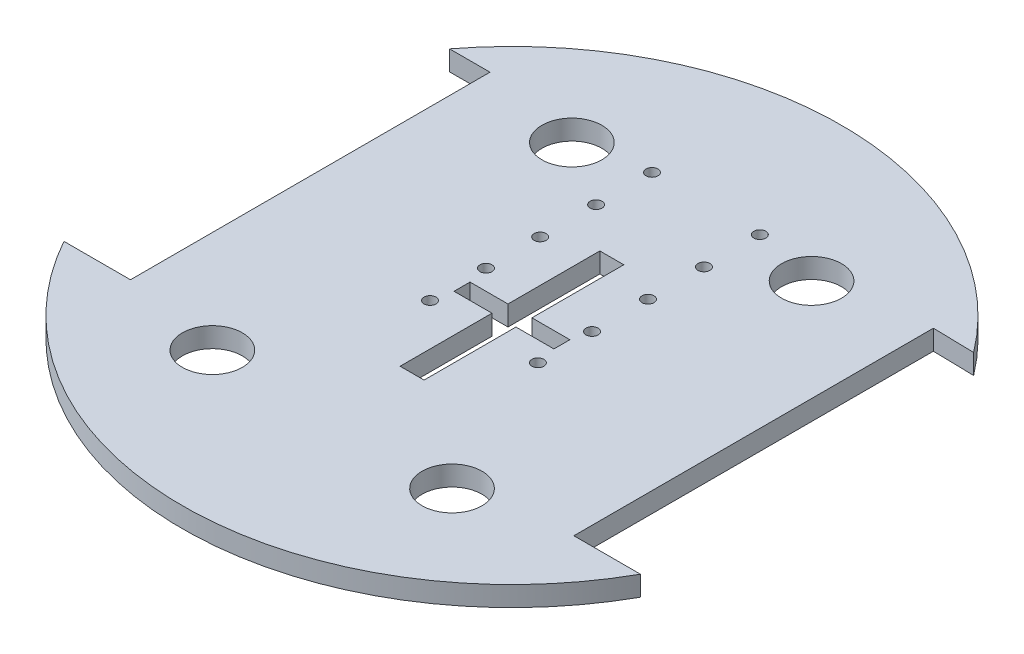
ISO-10303-21;
HEADER;
FILE_DESCRIPTION(('STEP AP214'),'2;1');
FILE_NAME('part.step','',(''),(''),'','','');
FILE_SCHEMA(('AUTOMOTIVE_DESIGN { 1 0 10303 214 1 1 1 1 }'));
ENDSEC;
DATA;
#1=APPLICATION_CONTEXT('core data for automotive mechanical design processes');
#2=APPLICATION_PROTOCOL_DEFINITION('international standard','automotive_design',2000,#1);
#3=PRODUCT_CONTEXT('',#1,'mechanical');
#4=PRODUCT('Part','Part','',(#3));
#5=PRODUCT_RELATED_PRODUCT_CATEGORY('part','',(#4));
#6=PRODUCT_DEFINITION_FORMATION('','',#4);
#7=PRODUCT_DEFINITION_CONTEXT('part definition',#1,'design');
#8=PRODUCT_DEFINITION('design','',#6,#7);
#9=PRODUCT_DEFINITION_SHAPE('','',#8);
#10=(LENGTH_UNIT() NAMED_UNIT(*) SI_UNIT(.MILLI.,.METRE.));
#11=(NAMED_UNIT(*) PLANE_ANGLE_UNIT() SI_UNIT($,.RADIAN.));
#12=(NAMED_UNIT(*) SI_UNIT($,.STERADIAN.) SOLID_ANGLE_UNIT());
#13=UNCERTAINTY_MEASURE_WITH_UNIT(LENGTH_MEASURE(1.E-05),#10,'distance_accuracy_value','');
#14=(GEOMETRIC_REPRESENTATION_CONTEXT(3) GLOBAL_UNCERTAINTY_ASSIGNED_CONTEXT((#13)) GLOBAL_UNIT_ASSIGNED_CONTEXT((#10,
#11,#12)) REPRESENTATION_CONTEXT('',''));
#15=CARTESIAN_POINT('',(0.,0.,0.));
#16=DIRECTION('',(0.,0.,1.));
#17=DIRECTION('',(1.,0.,0.));
#18=AXIS2_PLACEMENT_3D('',#15,#16,#17);
#19=CARTESIAN_POINT('',(3.,0.,-25.));
#20=DIRECTION('',(1.,0.,0.));
#21=DIRECTION('',(0.,0.,-1.));
#22=AXIS2_PLACEMENT_3D('',#19,#20,#21);
#23=PLANE('',#22);
#24=DIRECTION('',(0.,0.,1.));
#25=VECTOR('',#24,1.);
#26=CARTESIAN_POINT('',(3.,0.,-25.));
#27=LINE('',#26,#25);
#28=CARTESIAN_POINT('',(3.,0.,2.));
#29=VERTEX_POINT('',#28);
#30=CARTESIAN_POINT('',(3.,0.,25.));
#31=VERTEX_POINT('',#30);
#32=EDGE_CURVE('E249',#29,#31,#27,.T.);
#33=ORIENTED_EDGE('',*,*,#32,.F.);
#34=DIRECTION('',(0.,-1.,0.));
#35=VECTOR('',#34,1.);
#36=CARTESIAN_POINT('',(3.,0.,2.));
#37=LINE('',#36,#35);
#38=CARTESIAN_POINT('',(3.,-5.,2.));
#39=VERTEX_POINT('',#38);
#40=EDGE_CURVE('E239',#29,#39,#37,.T.);
#41=ORIENTED_EDGE('',*,*,#40,.T.);
#42=DIRECTION('',(0.,0.,1.));
#43=VECTOR('',#42,1.);
#44=CARTESIAN_POINT('',(3.,-5.,-25.));
#45=LINE('',#44,#43);
#46=CARTESIAN_POINT('',(3.,-5.,25.));
#47=VERTEX_POINT('',#46);
#48=EDGE_CURVE('E243',#39,#47,#45,.T.);
#49=ORIENTED_EDGE('',*,*,#48,.T.);
#50=DIRECTION('',(0.,-1.,0.));
#51=VECTOR('',#50,1.);
#52=CARTESIAN_POINT('',(3.,0.,25.));
#53=LINE('',#52,#51);
#54=EDGE_CURVE('E261',#31,#47,#53,.T.);
#55=ORIENTED_EDGE('',*,*,#54,.F.);
#56=EDGE_LOOP('',(#33,#41,#49,#55));
#57=FACE_BOUND('',#56,.T.);
#58=ADVANCED_FACE('F41',(#57),#23,.F.);
#59=CARTESIAN_POINT('',(-3.,0.,-25.));
#60=DIRECTION('',(-1.,0.,0.));
#61=DIRECTION('',(0.,0.,1.));
#62=AXIS2_PLACEMENT_3D('',#59,#60,#61);
#63=PLANE('',#62);
#64=DIRECTION('',(0.,0.,-1.));
#65=VECTOR('',#64,1.);
#66=CARTESIAN_POINT('',(-3.,-5.,-25.));
#67=LINE('',#66,#65);
#68=CARTESIAN_POINT('',(-3.,-5.,25.));
#69=VERTEX_POINT('',#68);
#70=CARTESIAN_POINT('',(-3.,-5.,2.));
#71=VERTEX_POINT('',#70);
#72=EDGE_CURVE('E271',#69,#71,#67,.T.);
#73=ORIENTED_EDGE('',*,*,#72,.T.);
#74=DIRECTION('',(0.,1.,0.));
#75=VECTOR('',#74,1.);
#76=CARTESIAN_POINT('',(-3.,0.,2.));
#77=LINE('',#76,#75);
#78=CARTESIAN_POINT('',(-3.,0.,2.));
#79=VERTEX_POINT('',#78);
#80=EDGE_CURVE('E11',#71,#79,#77,.T.);
#81=ORIENTED_EDGE('',*,*,#80,.T.);
#82=DIRECTION('',(0.,0.,-1.));
#83=VECTOR('',#82,1.);
#84=CARTESIAN_POINT('',(-3.,0.,-25.));
#85=LINE('',#84,#83);
#86=CARTESIAN_POINT('',(-3.,0.,25.));
#87=VERTEX_POINT('',#86);
#88=EDGE_CURVE('E254',#87,#79,#85,.T.);
#89=ORIENTED_EDGE('',*,*,#88,.F.);
#90=DIRECTION('',(0.,-1.,0.));
#91=VECTOR('',#90,1.);
#92=CARTESIAN_POINT('',(-3.,0.,25.));
#93=LINE('',#92,#91);
#94=EDGE_CURVE('E287',#87,#69,#93,.T.);
#95=ORIENTED_EDGE('',*,*,#94,.T.);
#96=EDGE_LOOP('',(#73,#81,#89,#95));
#97=FACE_BOUND('',#96,.T.);
#98=ADVANCED_FACE('F529',(#97),#63,.F.);
#99=CARTESIAN_POINT('',(0.,-5.,0.));
#100=DIRECTION('',(0.,1.,0.));
#101=DIRECTION('',(0.,0.,1.));
#102=AXIS2_PLACEMENT_3D('',#99,#100,#101);
#103=CYLINDRICAL_SURFACE('',#102,82.5);
#104=DIRECTION('',(0.,-1.,0.));
#105=VECTOR('',#104,1.);
#106=CARTESIAN_POINT('',(65.7929290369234,0.,-49.774898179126));
#107=LINE('',#106,#105);
#108=CARTESIAN_POINT('',(65.7929290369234,0.,-49.774898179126));
#109=VERTEX_POINT('',#108);
#110=CARTESIAN_POINT('',(65.7929290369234,-5.,-49.774898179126));
#111=VERTEX_POINT('',#110);
#112=EDGE_CURVE('E418',#109,#111,#107,.T.);
#113=ORIENTED_EDGE('',*,*,#112,.T.);
#114=CARTESIAN_POINT('',(0.,-5.,0.));
#115=DIRECTION('',(0.,1.,0.));
#116=DIRECTION('',(0.,0.,1.));
#117=AXIS2_PLACEMENT_3D('',#114,#115,#116);
#118=CIRCLE('',#117,82.5);
#119=CARTESIAN_POINT('',(-65.6220237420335,-5.,-50.));
#120=VERTEX_POINT('',#119);
#121=EDGE_CURVE('E481',#111,#120,#118,.T.);
#122=ORIENTED_EDGE('',*,*,#121,.T.);
#123=DIRECTION('',(0.,-1.,0.));
#124=VECTOR('',#123,1.);
#125=CARTESIAN_POINT('',(-65.6220237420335,0.,-50.));
#126=LINE('',#125,#124);
#127=CARTESIAN_POINT('',(-65.6220237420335,0.,-50.));
#128=VERTEX_POINT('',#127);
#129=EDGE_CURVE('E456',#128,#120,#126,.T.);
#130=ORIENTED_EDGE('',*,*,#129,.F.);
#131=CARTESIAN_POINT('',(0.,0.,0.));
#132=DIRECTION('',(0.,1.,0.));
#133=DIRECTION('',(0.,0.,1.));
#134=AXIS2_PLACEMENT_3D('',#131,#132,#133);
#135=CIRCLE('',#134,82.5);
#136=EDGE_CURVE('E482',#109,#128,#135,.T.);
#137=ORIENTED_EDGE('',*,*,#136,.F.);
#138=EDGE_LOOP('',(#113,#122,#130,#137));
#139=FACE_BOUND('',#138,.T.);
#140=ADVANCED_FACE('F493',(#139),#103,.T.);
#141=DIRECTION('',(0.,-1.,0.));
#142=VECTOR('',#141,1.);
#143=CARTESIAN_POINT('',(72.1543484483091,0.,40.));
#144=LINE('',#143,#142);
#145=CARTESIAN_POINT('',(72.1543484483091,0.,40.));
#146=VERTEX_POINT('',#145);
#147=CARTESIAN_POINT('',(72.1543484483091,-5.,40.));
#148=VERTEX_POINT('',#147);
#149=EDGE_CURVE('E437',#146,#148,#144,.T.);
#150=ORIENTED_EDGE('',*,*,#149,.F.);
#151=CARTESIAN_POINT('',(-72.1543484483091,0.,40.));
#152=VERTEX_POINT('',#151);
#153=EDGE_CURVE('E433',#152,#146,#135,.T.);
#154=ORIENTED_EDGE('',*,*,#153,.F.);
#155=DIRECTION('',(0.,-1.,0.));
#156=VECTOR('',#155,1.);
#157=CARTESIAN_POINT('',(-72.1543484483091,0.,40.));
#158=LINE('',#157,#156);
#159=CARTESIAN_POINT('',(-72.1543484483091,-5.,40.));
#160=VERTEX_POINT('',#159);
#161=EDGE_CURVE('E423',#152,#160,#158,.T.);
#162=ORIENTED_EDGE('',*,*,#161,.T.);
#163=EDGE_CURVE('E477',#160,#148,#118,.T.);
#164=ORIENTED_EDGE('',*,*,#163,.T.);
#165=EDGE_LOOP('',(#150,#154,#162,#164));
#166=FACE_BOUND('',#165,.T.);
#167=ADVANCED_FACE('F43',(#166),#103,.T.);
#168=CARTESIAN_POINT('',(0.,-5.,0.));
#169=DIRECTION('',(0.,1.,0.));
#170=DIRECTION('',(0.,0.,1.));
#171=AXIS2_PLACEMENT_3D('',#168,#169,#170);
#172=PLANE('',#171);
#173=ORIENTED_EDGE('',*,*,#48,.F.);
#174=DIRECTION('',(-1.,0.,0.));
#175=VECTOR('',#174,1.);
#176=CARTESIAN_POINT('',(12.5,-5.,2.));
#177=LINE('',#176,#175);
#178=CARTESIAN_POINT('',(12.5,-5.,2.));
#179=VERTEX_POINT('',#178);
#180=EDGE_CURVE('E206',#179,#39,#177,.T.);
#181=ORIENTED_EDGE('',*,*,#180,.F.);
#182=DIRECTION('',(0.,0.,1.));
#183=VECTOR('',#182,1.);
#184=CARTESIAN_POINT('',(12.5,-5.,-2.));
#185=LINE('',#184,#183);
#186=CARTESIAN_POINT('',(12.5,-5.,-2.));
#187=VERTEX_POINT('',#186);
#188=EDGE_CURVE('E223',#187,#179,#185,.T.);
#189=ORIENTED_EDGE('',*,*,#188,.F.);
#190=DIRECTION('',(1.,0.,0.));
#191=VECTOR('',#190,1.);
#192=CARTESIAN_POINT('',(12.5,-5.,-2.));
#193=LINE('',#192,#191);
#194=CARTESIAN_POINT('',(3.,-5.,-2.));
#195=VERTEX_POINT('',#194);
#196=EDGE_CURVE('E220',#195,#187,#193,.T.);
#197=ORIENTED_EDGE('',*,*,#196,.F.);
#198=CARTESIAN_POINT('',(3.,-5.,-25.));
#199=VERTEX_POINT('',#198);
#200=EDGE_CURVE('E262',#199,#195,#45,.T.);
#201=ORIENTED_EDGE('',*,*,#200,.F.);
#202=DIRECTION('',(1.,0.,0.));
#203=VECTOR('',#202,1.);
#204=CARTESIAN_POINT('',(-3.,-5.,-25.));
#205=LINE('',#204,#203);
#206=CARTESIAN_POINT('',(-3.,-5.,-25.));
#207=VERTEX_POINT('',#206);
#208=EDGE_CURVE('E275',#207,#199,#205,.T.);
#209=ORIENTED_EDGE('',*,*,#208,.F.);
#210=CARTESIAN_POINT('',(-3.,-5.,-2.));
#211=VERTEX_POINT('',#210);
#212=EDGE_CURVE('E270',#211,#207,#67,.T.);
#213=ORIENTED_EDGE('',*,*,#212,.F.);
#214=CARTESIAN_POINT('',(-12.5,-5.,-2.));
#215=VERTEX_POINT('',#214);
#216=EDGE_CURVE('E65',#215,#211,#193,.T.);
#217=ORIENTED_EDGE('',*,*,#216,.F.);
#218=DIRECTION('',(0.,0.,-1.));
#219=VECTOR('',#218,1.);
#220=CARTESIAN_POINT('',(-12.5,-5.,-2.));
#221=LINE('',#220,#219);
#222=CARTESIAN_POINT('',(-12.5,-5.,2.));
#223=VERTEX_POINT('',#222);
#224=EDGE_CURVE('E187',#223,#215,#221,.T.);
#225=ORIENTED_EDGE('',*,*,#224,.F.);
#226=EDGE_CURVE('E210',#71,#223,#177,.T.);
#227=ORIENTED_EDGE('',*,*,#226,.F.);
#228=ORIENTED_EDGE('',*,*,#72,.F.);
#229=DIRECTION('',(-1.,0.,0.));
#230=VECTOR('',#229,1.);
#231=CARTESIAN_POINT('',(-3.,-5.,25.));
#232=LINE('',#231,#230);
#233=EDGE_CURVE('E266',#47,#69,#232,.T.);
#234=ORIENTED_EDGE('',*,*,#233,.F.);
#235=EDGE_LOOP('',(#173,#181,#189,#197,#201,#209,#213,#217,#225,#227,#228,#234));
#236=FACE_BOUND('',#235,.T.);
#237=CARTESIAN_POINT('',(30.,-5.,45.));
#238=DIRECTION('',(0.,-1.,0.));
#239=DIRECTION('',(0.,0.,1.));
#240=AXIS2_PLACEMENT_3D('',#237,#238,#239);
#241=CIRCLE('',#240,7.49999999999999);
#242=CARTESIAN_POINT('',(30.,-5.,52.5));
#243=VERTEX_POINT('',#242);
#244=EDGE_CURVE('E306',#243,#243,#241,.T.);
#245=ORIENTED_EDGE('',*,*,#244,.F.);
#246=EDGE_LOOP('',(#245));
#247=FACE_BOUND('',#246,.T.);
#248=CARTESIAN_POINT('',(-30.,-5.,-45.));
#249=DIRECTION('',(0.,-1.,0.));
#250=DIRECTION('',(0.,0.,1.));
#251=AXIS2_PLACEMENT_3D('',#248,#249,#250);
#252=CIRCLE('',#251,7.49999999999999);
#253=CARTESIAN_POINT('',(-30.,-5.,-37.5));
#254=VERTEX_POINT('',#253);
#255=EDGE_CURVE('E297',#254,#254,#252,.T.);
#256=ORIENTED_EDGE('',*,*,#255,.F.);
#257=EDGE_LOOP('',(#256));
#258=FACE_BOUND('',#257,.T.);
#259=CARTESIAN_POINT('',(30.,-5.,-45.));
#260=DIRECTION('',(0.,-1.,0.));
#261=DIRECTION('',(0.,0.,-1.));
#262=AXIS2_PLACEMENT_3D('',#259,#260,#261);
#263=CIRCLE('',#262,7.49999999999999);
#264=CARTESIAN_POINT('',(30.,-5.,-52.5));
#265=VERTEX_POINT('',#264);
#266=EDGE_CURVE('E282',#265,#265,#263,.T.);
#267=ORIENTED_EDGE('',*,*,#266,.F.);
#268=EDGE_LOOP('',(#267));
#269=FACE_BOUND('',#268,.T.);
#270=CARTESIAN_POINT('',(-30.,-5.,45.));
#271=DIRECTION('',(0.,-1.,0.));
#272=DIRECTION('',(0.,0.,-1.));
#273=AXIS2_PLACEMENT_3D('',#270,#271,#272);
#274=CIRCLE('',#273,7.49999999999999);
#275=CARTESIAN_POINT('',(-30.,-5.,37.5));
#276=VERTEX_POINT('',#275);
#277=EDGE_CURVE('E305',#276,#276,#274,.T.);
#278=ORIENTED_EDGE('',*,*,#277,.F.);
#279=EDGE_LOOP('',(#278));
#280=FACE_BOUND('',#279,.T.);
#281=CARTESIAN_POINT('',(13.5,-5.,7.));
#282=DIRECTION('',(0.,-1.,0.));
#283=DIRECTION('',(0.,0.,1.));
#284=AXIS2_PLACEMENT_3D('',#281,#282,#283);
#285=CIRCLE('',#284,1.5);
#286=CARTESIAN_POINT('',(13.5,-5.,8.5));
#287=VERTEX_POINT('',#286);
#288=EDGE_CURVE('E346',#287,#287,#285,.T.);
#289=ORIENTED_EDGE('',*,*,#288,.F.);
#290=EDGE_LOOP('',(#289));
#291=FACE_BOUND('',#290,.T.);
#292=CARTESIAN_POINT('',(-13.5,-5.,-7.00000000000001));
#293=DIRECTION('',(0.,-1.,0.));
#294=DIRECTION('',(0.,0.,1.));
#295=AXIS2_PLACEMENT_3D('',#292,#293,#294);
#296=CIRCLE('',#295,1.5);
#297=CARTESIAN_POINT('',(-13.5,-5.,-5.50000000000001));
#298=VERTEX_POINT('',#297);
#299=EDGE_CURVE('E338',#298,#298,#296,.T.);
#300=ORIENTED_EDGE('',*,*,#299,.F.);
#301=EDGE_LOOP('',(#300));
#302=FACE_BOUND('',#301,.T.);
#303=CARTESIAN_POINT('',(13.5,-5.,-6.55440345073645));
#304=DIRECTION('',(0.,-1.,0.));
#305=DIRECTION('',(0.,0.,-1.));
#306=AXIS2_PLACEMENT_3D('',#303,#304,#305);
#307=CIRCLE('',#306,1.5);
#308=CARTESIAN_POINT('',(13.5,-5.,-8.05440345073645));
#309=VERTEX_POINT('',#308);
#310=EDGE_CURVE('E337',#309,#309,#307,.T.);
#311=ORIENTED_EDGE('',*,*,#310,.F.);
#312=EDGE_LOOP('',(#311));
#313=FACE_BOUND('',#312,.T.);
#314=CARTESIAN_POINT('',(-13.5,-5.,7.00000000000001));
#315=DIRECTION('',(0.,-1.,0.));
#316=DIRECTION('',(0.,0.,-1.));
#317=AXIS2_PLACEMENT_3D('',#314,#315,#316);
#318=CIRCLE('',#317,1.5);
#319=CARTESIAN_POINT('',(-13.5,-5.,5.50000000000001));
#320=VERTEX_POINT('',#319);
#321=EDGE_CURVE('E356',#320,#320,#318,.T.);
#322=ORIENTED_EDGE('',*,*,#321,.F.);
#323=EDGE_LOOP('',(#322));
#324=FACE_BOUND('',#323,.T.);
#325=CARTESIAN_POINT('',(-13.5,-5.,-20.5544034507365));
#326=DIRECTION('',(0.,-1.,0.));
#327=DIRECTION('',(0.,0.,-1.));
#328=AXIS2_PLACEMENT_3D('',#325,#326,#327);
#329=CIRCLE('',#328,1.5);
#330=CARTESIAN_POINT('',(-13.5,-5.,-22.0544034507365));
#331=VERTEX_POINT('',#330);
#332=EDGE_CURVE('E370',#331,#331,#329,.T.);
#333=ORIENTED_EDGE('',*,*,#332,.F.);
#334=EDGE_LOOP('',(#333));
#335=FACE_BOUND('',#334,.T.);
#336=CARTESIAN_POINT('',(13.5,-5.,-34.5544034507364));
#337=DIRECTION('',(0.,-1.,0.));
#338=DIRECTION('',(0.,0.,-1.));
#339=AXIS2_PLACEMENT_3D('',#336,#337,#338);
#340=CIRCLE('',#339,1.5);
#341=CARTESIAN_POINT('',(13.5,-5.,-36.0544034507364));
#342=VERTEX_POINT('',#341);
#343=EDGE_CURVE('E378',#342,#342,#340,.T.);
#344=ORIENTED_EDGE('',*,*,#343,.F.);
#345=EDGE_LOOP('',(#344));
#346=FACE_BOUND('',#345,.T.);
#347=CARTESIAN_POINT('',(13.5,-5.,-48.5544034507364));
#348=DIRECTION('',(0.,-1.,0.));
#349=DIRECTION('',(0.,0.,-1.));
#350=AXIS2_PLACEMENT_3D('',#347,#348,#349);
#351=CIRCLE('',#350,1.5);
#352=CARTESIAN_POINT('',(13.5,-5.,-50.0544034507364));
#353=VERTEX_POINT('',#352);
#354=EDGE_CURVE('E386',#353,#353,#351,.T.);
#355=ORIENTED_EDGE('',*,*,#354,.F.);
#356=EDGE_LOOP('',(#355));
#357=FACE_BOUND('',#356,.T.);
#358=CARTESIAN_POINT('',(-13.5,-5.,-48.5544034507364));
#359=DIRECTION('',(0.,-1.,0.));
#360=DIRECTION('',(0.,0.,-1.));
#361=AXIS2_PLACEMENT_3D('',#358,#359,#360);
#362=CIRCLE('',#361,1.5);
#363=CARTESIAN_POINT('',(-13.5,-5.,-50.0544034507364));
#364=VERTEX_POINT('',#363);
#365=EDGE_CURVE('E329',#364,#364,#362,.T.);
#366=ORIENTED_EDGE('',*,*,#365,.F.);
#367=EDGE_LOOP('',(#366));
#368=FACE_BOUND('',#367,.T.);
#369=CARTESIAN_POINT('',(-13.5,-5.,-34.5544034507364));
#370=DIRECTION('',(0.,-1.,0.));
#371=DIRECTION('',(0.,0.,-1.));
#372=AXIS2_PLACEMENT_3D('',#369,#370,#371);
#373=CIRCLE('',#372,1.5);
#374=CARTESIAN_POINT('',(-13.5,-5.,-36.0544034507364));
#375=VERTEX_POINT('',#374);
#376=EDGE_CURVE('E321',#375,#375,#373,.T.);
#377=ORIENTED_EDGE('',*,*,#376,.F.);
#378=EDGE_LOOP('',(#377));
#379=FACE_BOUND('',#378,.T.);
#380=CARTESIAN_POINT('',(13.5,-5.,-20.5544034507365));
#381=DIRECTION('',(0.,-1.,0.));
#382=DIRECTION('',(0.,0.,-1.));
#383=AXIS2_PLACEMENT_3D('',#380,#381,#382);
#384=CIRCLE('',#383,1.5);
#385=CARTESIAN_POINT('',(13.5,-5.,-22.0544034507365));
#386=VERTEX_POINT('',#385);
#387=EDGE_CURVE('E355',#386,#386,#384,.T.);
#388=ORIENTED_EDGE('',*,*,#387,.F.);
#389=EDGE_LOOP('',(#388));
#390=FACE_BOUND('',#389,.T.);
#391=ORIENTED_EDGE('',*,*,#121,.F.);
#392=DIRECTION('',(0.999760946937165,0.,0.0218643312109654));
#393=VECTOR('',#392,1.);
#394=CARTESIAN_POINT('',(65.7929290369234,-5.,-49.774898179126));
#395=LINE('',#394,#393);
#396=CARTESIAN_POINT('',(55.5,-5.,-50.));
#397=VERTEX_POINT('',#396);
#398=EDGE_CURVE('E419',#397,#111,#395,.T.);
#399=ORIENTED_EDGE('',*,*,#398,.F.);
#400=DIRECTION('',(0.,0.,-1.));
#401=VECTOR('',#400,1.);
#402=CARTESIAN_POINT('',(55.5,-5.,-50.));
#403=LINE('',#402,#401);
#404=CARTESIAN_POINT('',(55.5,-5.,40.));
#405=VERTEX_POINT('',#404);
#406=EDGE_CURVE('E410',#405,#397,#403,.T.);
#407=ORIENTED_EDGE('',*,*,#406,.F.);
#408=DIRECTION('',(-1.,0.,0.));
#409=VECTOR('',#408,1.);
#410=CARTESIAN_POINT('',(72.1543484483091,-5.,40.));
#411=LINE('',#410,#409);
#412=EDGE_CURVE('E422',#148,#405,#411,.T.);
#413=ORIENTED_EDGE('',*,*,#412,.F.);
#414=ORIENTED_EDGE('',*,*,#163,.F.);
#415=DIRECTION('',(-1.,0.,0.));
#416=VECTOR('',#415,1.);
#417=CARTESIAN_POINT('',(-72.1543484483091,-5.,40.));
#418=LINE('',#417,#416);
#419=CARTESIAN_POINT('',(-55.5,-5.,40.));
#420=VERTEX_POINT('',#419);
#421=EDGE_CURVE('E448',#420,#160,#418,.T.);
#422=ORIENTED_EDGE('',*,*,#421,.F.);
#423=DIRECTION('',(0.,0.,1.));
#424=VECTOR('',#423,1.);
#425=CARTESIAN_POINT('',(-55.5,-5.,-50.));
#426=LINE('',#425,#424);
#427=CARTESIAN_POINT('',(-55.5,-5.,-50.));
#428=VERTEX_POINT('',#427);
#429=EDGE_CURVE('E460',#428,#420,#426,.T.);
#430=ORIENTED_EDGE('',*,*,#429,.F.);
#431=DIRECTION('',(1.,0.,0.));
#432=VECTOR('',#431,1.);
#433=CARTESIAN_POINT('',(-65.6220237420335,-5.,-50.));
#434=LINE('',#433,#432);
#435=EDGE_CURVE('E401',#120,#428,#434,.T.);
#436=ORIENTED_EDGE('',*,*,#435,.F.);
#437=EDGE_LOOP('',(#391,#399,#407,#413,#414,#422,#430,#436));
#438=FACE_BOUND('',#437,.T.);
#439=ADVANCED_FACE('F499',(#236,#247,#258,#269,#280,#291,#302,#313,#324,#335,#346,#357,#368,
#379,#390,#438),#172,.F.);
#440=CARTESIAN_POINT('',(0.,0.,0.));
#441=DIRECTION('',(0.,1.,0.));
#442=DIRECTION('',(0.,0.,1.));
#443=AXIS2_PLACEMENT_3D('',#440,#441,#442);
#444=PLANE('',#443);
#445=DIRECTION('',(-1.,0.,0.));
#446=VECTOR('',#445,1.);
#447=CARTESIAN_POINT('',(12.5,0.,2.));
#448=LINE('',#447,#446);
#449=CARTESIAN_POINT('',(12.5,0.,2.));
#450=VERTEX_POINT('',#449);
#451=EDGE_CURVE('E190',#450,#29,#448,.T.);
#452=ORIENTED_EDGE('',*,*,#451,.T.);
#453=ORIENTED_EDGE('',*,*,#32,.T.);
#454=DIRECTION('',(-1.,0.,0.));
#455=VECTOR('',#454,1.);
#456=CARTESIAN_POINT('',(-3.,0.,25.));
#457=LINE('',#456,#455);
#458=EDGE_CURVE('E248',#31,#87,#457,.T.);
#459=ORIENTED_EDGE('',*,*,#458,.T.);
#460=ORIENTED_EDGE('',*,*,#88,.T.);
#461=CARTESIAN_POINT('',(-12.5,0.,2.));
#462=VERTEX_POINT('',#461);
#463=EDGE_CURVE('E204',#79,#462,#448,.T.);
#464=ORIENTED_EDGE('',*,*,#463,.T.);
#465=DIRECTION('',(0.,0.,-1.));
#466=VECTOR('',#465,1.);
#467=CARTESIAN_POINT('',(-12.5,0.,-2.));
#468=LINE('',#467,#466);
#469=CARTESIAN_POINT('',(-12.5,0.,-2.));
#470=VERTEX_POINT('',#469);
#471=EDGE_CURVE('E184',#462,#470,#468,.T.);
#472=ORIENTED_EDGE('',*,*,#471,.T.);
#473=DIRECTION('',(1.,0.,0.));
#474=VECTOR('',#473,1.);
#475=CARTESIAN_POINT('',(12.5,0.,-2.));
#476=LINE('',#475,#474);
#477=CARTESIAN_POINT('',(-3.,0.,-2.));
#478=VERTEX_POINT('',#477);
#479=EDGE_CURVE('E193',#470,#478,#476,.T.);
#480=ORIENTED_EDGE('',*,*,#479,.T.);
#481=CARTESIAN_POINT('',(-3.,0.,-25.));
#482=VERTEX_POINT('',#481);
#483=EDGE_CURVE('E253',#478,#482,#85,.T.);
#484=ORIENTED_EDGE('',*,*,#483,.T.);
#485=DIRECTION('',(1.,0.,0.));
#486=VECTOR('',#485,1.);
#487=CARTESIAN_POINT('',(-3.,0.,-25.));
#488=LINE('',#487,#486);
#489=CARTESIAN_POINT('',(3.,0.,-25.));
#490=VERTEX_POINT('',#489);
#491=EDGE_CURVE('E257',#482,#490,#488,.T.);
#492=ORIENTED_EDGE('',*,*,#491,.T.);
#493=CARTESIAN_POINT('',(3.,0.,-2.));
#494=VERTEX_POINT('',#493);
#495=EDGE_CURVE('E244',#490,#494,#27,.T.);
#496=ORIENTED_EDGE('',*,*,#495,.T.);
#497=CARTESIAN_POINT('',(12.5,0.,-2.));
#498=VERTEX_POINT('',#497);
#499=EDGE_CURVE('E57',#494,#498,#476,.T.);
#500=ORIENTED_EDGE('',*,*,#499,.T.);
#501=DIRECTION('',(0.,0.,1.));
#502=VECTOR('',#501,1.);
#503=CARTESIAN_POINT('',(12.5,0.,-2.));
#504=LINE('',#503,#502);
#505=EDGE_CURVE('E198',#498,#450,#504,.T.);
#506=ORIENTED_EDGE('',*,*,#505,.T.);
#507=EDGE_LOOP('',(#452,#453,#459,#460,#464,#472,#480,#484,#492,#496,#500,#506));
#508=FACE_BOUND('',#507,.T.);
#509=CARTESIAN_POINT('',(30.,0.,45.));
#510=DIRECTION('',(0.,-1.,0.));
#511=DIRECTION('',(0.,0.,1.));
#512=AXIS2_PLACEMENT_3D('',#509,#510,#511);
#513=CIRCLE('',#512,7.49999999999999);
#514=CARTESIAN_POINT('',(30.,0.,52.5));
#515=VERTEX_POINT('',#514);
#516=EDGE_CURVE('E301',#515,#515,#513,.T.);
#517=ORIENTED_EDGE('',*,*,#516,.T.);
#518=EDGE_LOOP('',(#517));
#519=FACE_BOUND('',#518,.T.);
#520=CARTESIAN_POINT('',(-30.,0.,-45.));
#521=DIRECTION('',(0.,-1.,0.));
#522=DIRECTION('',(0.,0.,1.));
#523=AXIS2_PLACEMENT_3D('',#520,#521,#522);
#524=CIRCLE('',#523,7.49999999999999);
#525=CARTESIAN_POINT('',(-30.,0.,-37.5));
#526=VERTEX_POINT('',#525);
#527=EDGE_CURVE('E310',#526,#526,#524,.T.);
#528=ORIENTED_EDGE('',*,*,#527,.T.);
#529=EDGE_LOOP('',(#528));
#530=FACE_BOUND('',#529,.T.);
#531=CARTESIAN_POINT('',(30.,0.,-45.));
#532=DIRECTION('',(0.,-1.,0.));
#533=DIRECTION('',(0.,0.,-1.));
#534=AXIS2_PLACEMENT_3D('',#531,#532,#533);
#535=CIRCLE('',#534,7.49999999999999);
#536=CARTESIAN_POINT('',(30.,0.,-52.5));
#537=VERTEX_POINT('',#536);
#538=EDGE_CURVE('E293',#537,#537,#535,.T.);
#539=ORIENTED_EDGE('',*,*,#538,.T.);
#540=EDGE_LOOP('',(#539));
#541=FACE_BOUND('',#540,.T.);
#542=CARTESIAN_POINT('',(-30.,0.,45.));
#543=DIRECTION('',(0.,-1.,0.));
#544=DIRECTION('',(0.,0.,-1.));
#545=AXIS2_PLACEMENT_3D('',#542,#543,#544);
#546=CIRCLE('',#545,7.49999999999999);
#547=CARTESIAN_POINT('',(-30.,0.,37.5));
#548=VERTEX_POINT('',#547);
#549=EDGE_CURVE('E317',#548,#548,#546,.T.);
#550=ORIENTED_EDGE('',*,*,#549,.T.);
#551=EDGE_LOOP('',(#550));
#552=FACE_BOUND('',#551,.T.);
#553=CARTESIAN_POINT('',(13.5,0.,7.));
#554=DIRECTION('',(0.,-1.,0.));
#555=DIRECTION('',(0.,0.,1.));
#556=AXIS2_PLACEMENT_3D('',#553,#554,#555);
#557=CIRCLE('',#556,1.5);
#558=CARTESIAN_POINT('',(13.5,0.,8.5));
#559=VERTEX_POINT('',#558);
#560=EDGE_CURVE('E342',#559,#559,#557,.T.);
#561=ORIENTED_EDGE('',*,*,#560,.T.);
#562=EDGE_LOOP('',(#561));
#563=FACE_BOUND('',#562,.T.);
#564=CARTESIAN_POINT('',(-13.5,0.,-7.00000000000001));
#565=DIRECTION('',(0.,-1.,0.));
#566=DIRECTION('',(0.,0.,1.));
#567=AXIS2_PLACEMENT_3D('',#564,#565,#566);
#568=CIRCLE('',#567,1.5);
#569=CARTESIAN_POINT('',(-13.5,0.,-5.50000000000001));
#570=VERTEX_POINT('',#569);
#571=EDGE_CURVE('E333',#570,#570,#568,.T.);
#572=ORIENTED_EDGE('',*,*,#571,.T.);
#573=EDGE_LOOP('',(#572));
#574=FACE_BOUND('',#573,.T.);
#575=CARTESIAN_POINT('',(13.5,0.,-6.55440345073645));
#576=DIRECTION('',(0.,-1.,0.));
#577=DIRECTION('',(0.,0.,-1.));
#578=AXIS2_PLACEMENT_3D('',#575,#576,#577);
#579=CIRCLE('',#578,1.5);
#580=CARTESIAN_POINT('',(13.5,0.,-8.05440345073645));
#581=VERTEX_POINT('',#580);
#582=EDGE_CURVE('E360',#581,#581,#579,.T.);
#583=ORIENTED_EDGE('',*,*,#582,.T.);
#584=EDGE_LOOP('',(#583));
#585=FACE_BOUND('',#584,.T.);
#586=CARTESIAN_POINT('',(-13.5,0.,7.00000000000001));
#587=DIRECTION('',(0.,-1.,0.));
#588=DIRECTION('',(0.,0.,-1.));
#589=AXIS2_PLACEMENT_3D('',#586,#587,#588);
#590=CIRCLE('',#589,1.5);
#591=CARTESIAN_POINT('',(-13.5,0.,5.50000000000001));
#592=VERTEX_POINT('',#591);
#593=EDGE_CURVE('E351',#592,#592,#590,.T.);
#594=ORIENTED_EDGE('',*,*,#593,.T.);
#595=EDGE_LOOP('',(#594));
#596=FACE_BOUND('',#595,.T.);
#597=CARTESIAN_POINT('',(-13.5,0.,-20.5544034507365));
#598=DIRECTION('',(0.,-1.,0.));
#599=DIRECTION('',(0.,0.,-1.));
#600=AXIS2_PLACEMENT_3D('',#597,#598,#599);
#601=CIRCLE('',#600,1.5);
#602=CARTESIAN_POINT('',(-13.5,0.,-22.0544034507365));
#603=VERTEX_POINT('',#602);
#604=EDGE_CURVE('E350',#603,#603,#601,.T.);
#605=ORIENTED_EDGE('',*,*,#604,.T.);
#606=EDGE_LOOP('',(#605));
#607=FACE_BOUND('',#606,.T.);
#608=CARTESIAN_POINT('',(13.5,0.,-34.5544034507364));
#609=DIRECTION('',(0.,-1.,0.));
#610=DIRECTION('',(0.,0.,-1.));
#611=AXIS2_PLACEMENT_3D('',#608,#609,#610);
#612=CIRCLE('',#611,1.5);
#613=CARTESIAN_POINT('',(13.5,0.,-36.0544034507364));
#614=VERTEX_POINT('',#613);
#615=EDGE_CURVE('E374',#614,#614,#612,.T.);
#616=ORIENTED_EDGE('',*,*,#615,.T.);
#617=EDGE_LOOP('',(#616));
#618=FACE_BOUND('',#617,.T.);
#619=CARTESIAN_POINT('',(13.5,0.,-48.5544034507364));
#620=DIRECTION('',(0.,-1.,0.));
#621=DIRECTION('',(0.,0.,-1.));
#622=AXIS2_PLACEMENT_3D('',#619,#620,#621);
#623=CIRCLE('',#622,1.5);
#624=CARTESIAN_POINT('',(13.5,0.,-50.0544034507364));
#625=VERTEX_POINT('',#624);
#626=EDGE_CURVE('E382',#625,#625,#623,.T.);
#627=ORIENTED_EDGE('',*,*,#626,.T.);
#628=EDGE_LOOP('',(#627));
#629=FACE_BOUND('',#628,.T.);
#630=CARTESIAN_POINT('',(-13.5,0.,-48.5544034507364));
#631=DIRECTION('',(0.,-1.,0.));
#632=DIRECTION('',(0.,0.,-1.));
#633=AXIS2_PLACEMENT_3D('',#630,#631,#632);
#634=CIRCLE('',#633,1.5);
#635=CARTESIAN_POINT('',(-13.5,0.,-50.0544034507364));
#636=VERTEX_POINT('',#635);
#637=EDGE_CURVE('E390',#636,#636,#634,.T.);
#638=ORIENTED_EDGE('',*,*,#637,.T.);
#639=EDGE_LOOP('',(#638));
#640=FACE_BOUND('',#639,.T.);
#641=CARTESIAN_POINT('',(-13.5,0.,-34.5544034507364));
#642=DIRECTION('',(0.,-1.,0.));
#643=DIRECTION('',(0.,0.,-1.));
#644=AXIS2_PLACEMENT_3D('',#641,#642,#643);
#645=CIRCLE('',#644,1.5);
#646=CARTESIAN_POINT('',(-13.5,0.,-36.0544034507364));
#647=VERTEX_POINT('',#646);
#648=EDGE_CURVE('E325',#647,#647,#645,.T.);
#649=ORIENTED_EDGE('',*,*,#648,.T.);
#650=EDGE_LOOP('',(#649));
#651=FACE_BOUND('',#650,.T.);
#652=CARTESIAN_POINT('',(13.5,0.,-20.5544034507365));
#653=DIRECTION('',(0.,-1.,0.));
#654=DIRECTION('',(0.,0.,-1.));
#655=AXIS2_PLACEMENT_3D('',#652,#653,#654);
#656=CIRCLE('',#655,1.5);
#657=CARTESIAN_POINT('',(13.5,0.,-22.0544034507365));
#658=VERTEX_POINT('',#657);
#659=EDGE_CURVE('E397',#658,#658,#656,.T.);
#660=ORIENTED_EDGE('',*,*,#659,.T.);
#661=EDGE_LOOP('',(#660));
#662=FACE_BOUND('',#661,.T.);
#663=DIRECTION('',(0.999760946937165,0.,0.0218643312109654));
#664=VECTOR('',#663,1.);
#665=CARTESIAN_POINT('',(65.7929290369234,0.,-49.774898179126));
#666=LINE('',#665,#664);
#667=CARTESIAN_POINT('',(55.5,0.,-50.));
#668=VERTEX_POINT('',#667);
#669=EDGE_CURVE('E405',#668,#109,#666,.T.);
#670=ORIENTED_EDGE('',*,*,#669,.T.);
#671=ORIENTED_EDGE('',*,*,#136,.T.);
#672=DIRECTION('',(1.,0.,0.));
#673=VECTOR('',#672,1.);
#674=CARTESIAN_POINT('',(-65.6220237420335,0.,-50.));
#675=LINE('',#674,#673);
#676=CARTESIAN_POINT('',(-55.5,0.,-50.));
#677=VERTEX_POINT('',#676);
#678=EDGE_CURVE('E443',#128,#677,#675,.T.);
#679=ORIENTED_EDGE('',*,*,#678,.T.);
#680=DIRECTION('',(0.,0.,1.));
#681=VECTOR('',#680,1.);
#682=CARTESIAN_POINT('',(-55.5,0.,-50.));
#683=LINE('',#682,#681);
#684=CARTESIAN_POINT('',(-55.5,0.,40.));
#685=VERTEX_POINT('',#684);
#686=EDGE_CURVE('E447',#677,#685,#683,.T.);
#687=ORIENTED_EDGE('',*,*,#686,.T.);
#688=DIRECTION('',(-1.,0.,0.));
#689=VECTOR('',#688,1.);
#690=CARTESIAN_POINT('',(-72.1543484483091,0.,40.));
#691=LINE('',#690,#689);
#692=EDGE_CURVE('E452',#685,#152,#691,.T.);
#693=ORIENTED_EDGE('',*,*,#692,.T.);
#694=ORIENTED_EDGE('',*,*,#153,.T.);
#695=DIRECTION('',(-1.,0.,0.));
#696=VECTOR('',#695,1.);
#697=CARTESIAN_POINT('',(72.1543484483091,0.,40.));
#698=LINE('',#697,#696);
#699=CARTESIAN_POINT('',(55.5,0.,40.));
#700=VERTEX_POINT('',#699);
#701=EDGE_CURVE('E409',#146,#700,#698,.T.);
#702=ORIENTED_EDGE('',*,*,#701,.T.);
#703=DIRECTION('',(0.,0.,-1.));
#704=VECTOR('',#703,1.);
#705=CARTESIAN_POINT('',(55.5,0.,-50.));
#706=LINE('',#705,#704);
#707=EDGE_CURVE('E414',#700,#668,#706,.T.);
#708=ORIENTED_EDGE('',*,*,#707,.T.);
#709=EDGE_LOOP('',(#670,#671,#679,#687,#693,#694,#702,#708));
#710=FACE_BOUND('',#709,.T.);
#711=ADVANCED_FACE('F201',(#508,#519,#530,#541,#552,#563,#574,#585,#596,#607,#618,#629,#640,
#651,#662,#710),#444,.T.);
#712=CARTESIAN_POINT('',(-72.1543484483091,0.,40.));
#713=DIRECTION('',(0.,0.,1.));
#714=DIRECTION('',(1.,0.,0.));
#715=AXIS2_PLACEMENT_3D('',#712,#713,#714);
#716=PLANE('',#715);
#717=ORIENTED_EDGE('',*,*,#421,.T.);
#718=ORIENTED_EDGE('',*,*,#161,.F.);
#719=ORIENTED_EDGE('',*,*,#692,.F.);
#720=DIRECTION('',(0.,-1.,0.));
#721=VECTOR('',#720,1.);
#722=CARTESIAN_POINT('',(-55.5,0.,40.));
#723=LINE('',#722,#721);
#724=EDGE_CURVE('E469',#685,#420,#723,.T.);
#725=ORIENTED_EDGE('',*,*,#724,.T.);
#726=EDGE_LOOP('',(#717,#718,#719,#725));
#727=FACE_BOUND('',#726,.T.);
#728=ADVANCED_FACE('F627',(#727),#716,.F.);
#729=CARTESIAN_POINT('',(-55.5,0.,-50.));
#730=DIRECTION('',(1.,0.,0.));
#731=DIRECTION('',(0.,0.,-1.));
#732=AXIS2_PLACEMENT_3D('',#729,#730,#731);
#733=PLANE('',#732);
#734=ORIENTED_EDGE('',*,*,#429,.T.);
#735=ORIENTED_EDGE('',*,*,#724,.F.);
#736=ORIENTED_EDGE('',*,*,#686,.F.);
#737=DIRECTION('',(0.,-1.,0.));
#738=VECTOR('',#737,1.);
#739=CARTESIAN_POINT('',(-55.5,0.,-50.));
#740=LINE('',#739,#738);
#741=EDGE_CURVE('E472',#677,#428,#740,.T.);
#742=ORIENTED_EDGE('',*,*,#741,.T.);
#743=EDGE_LOOP('',(#734,#735,#736,#742));
#744=FACE_BOUND('',#743,.T.);
#745=ADVANCED_FACE('F827',(#744),#733,.F.);
#746=CARTESIAN_POINT('',(-65.6220237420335,0.,-50.));
#747=DIRECTION('',(0.,0.,-1.));
#748=DIRECTION('',(-1.,0.,0.));
#749=AXIS2_PLACEMENT_3D('',#746,#747,#748);
#750=PLANE('',#749);
#751=ORIENTED_EDGE('',*,*,#435,.T.);
#752=ORIENTED_EDGE('',*,*,#741,.F.);
#753=ORIENTED_EDGE('',*,*,#678,.F.);
#754=ORIENTED_EDGE('',*,*,#129,.T.);
#755=EDGE_LOOP('',(#751,#752,#753,#754));
#756=FACE_BOUND('',#755,.T.);
#757=ADVANCED_FACE('F505',(#756),#750,.F.);
#758=CARTESIAN_POINT('',(65.7929290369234,0.,-49.774898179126));
#759=DIRECTION('',(0.0218643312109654,0.,-0.999760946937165));
#760=DIRECTION('',(-0.999760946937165,0.,-0.0218643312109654));
#761=AXIS2_PLACEMENT_3D('',#758,#759,#760);
#762=PLANE('',#761);
#763=ORIENTED_EDGE('',*,*,#398,.T.);
#764=ORIENTED_EDGE('',*,*,#112,.F.);
#765=ORIENTED_EDGE('',*,*,#669,.F.);
#766=DIRECTION('',(0.,-1.,0.));
#767=VECTOR('',#766,1.);
#768=CARTESIAN_POINT('',(55.5,0.,-50.));
#769=LINE('',#768,#767);
#770=EDGE_CURVE('E430',#668,#397,#769,.T.);
#771=ORIENTED_EDGE('',*,*,#770,.T.);
#772=EDGE_LOOP('',(#763,#764,#765,#771));
#773=FACE_BOUND('',#772,.T.);
#774=ADVANCED_FACE('F808',(#773),#762,.F.);
#775=CARTESIAN_POINT('',(55.5,0.,-50.));
#776=DIRECTION('',(-1.,0.,0.));
#777=DIRECTION('',(0.,0.,1.));
#778=AXIS2_PLACEMENT_3D('',#775,#776,#777);
#779=PLANE('',#778);
#780=ORIENTED_EDGE('',*,*,#406,.T.);
#781=ORIENTED_EDGE('',*,*,#770,.F.);
#782=ORIENTED_EDGE('',*,*,#707,.F.);
#783=DIRECTION('',(0.,-1.,0.));
#784=VECTOR('',#783,1.);
#785=CARTESIAN_POINT('',(55.5,0.,40.));
#786=LINE('',#785,#784);
#787=EDGE_CURVE('E434',#700,#405,#786,.T.);
#788=ORIENTED_EDGE('',*,*,#787,.T.);
#789=EDGE_LOOP('',(#780,#781,#782,#788));
#790=FACE_BOUND('',#789,.T.);
#791=ADVANCED_FACE('F798',(#790),#779,.F.);
#792=CARTESIAN_POINT('',(72.1543484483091,0.,40.));
#793=DIRECTION('',(0.,0.,1.));
#794=DIRECTION('',(1.,0.,0.));
#795=AXIS2_PLACEMENT_3D('',#792,#793,#794);
#796=PLANE('',#795);
#797=ORIENTED_EDGE('',*,*,#412,.T.);
#798=ORIENTED_EDGE('',*,*,#787,.F.);
#799=ORIENTED_EDGE('',*,*,#701,.F.);
#800=ORIENTED_EDGE('',*,*,#149,.T.);
#801=EDGE_LOOP('',(#797,#798,#799,#800));
#802=FACE_BOUND('',#801,.T.);
#803=ADVANCED_FACE('F788',(#802),#796,.F.);
#804=CARTESIAN_POINT('',(13.5,0.,-20.5544034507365));
#805=DIRECTION('',(0.,-1.,0.));
#806=DIRECTION('',(0.,0.,-1.));
#807=AXIS2_PLACEMENT_3D('',#804,#805,#806);
#808=CYLINDRICAL_SURFACE('',#807,1.5);
#809=ORIENTED_EDGE('',*,*,#659,.F.);
#810=EDGE_LOOP('',(#809));
#811=FACE_BOUND('',#810,.T.);
#812=ORIENTED_EDGE('',*,*,#387,.T.);
#813=EDGE_LOOP('',(#812));
#814=FACE_BOUND('',#813,.T.);
#815=ADVANCED_FACE('F778',(#811,#814),#808,.F.);
#816=CARTESIAN_POINT('',(-13.5,0.,-34.5544034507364));
#817=DIRECTION('',(0.,-1.,0.));
#818=DIRECTION('',(0.,0.,-1.));
#819=AXIS2_PLACEMENT_3D('',#816,#817,#818);
#820=CYLINDRICAL_SURFACE('',#819,1.5);
#821=ORIENTED_EDGE('',*,*,#648,.F.);
#822=EDGE_LOOP('',(#821));
#823=FACE_BOUND('',#822,.T.);
#824=ORIENTED_EDGE('',*,*,#376,.T.);
#825=EDGE_LOOP('',(#824));
#826=FACE_BOUND('',#825,.T.);
#827=ADVANCED_FACE('F768',(#823,#826),#820,.F.);
#828=CARTESIAN_POINT('',(-13.5,0.,-48.5544034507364));
#829=DIRECTION('',(0.,-1.,0.));
#830=DIRECTION('',(0.,0.,-1.));
#831=AXIS2_PLACEMENT_3D('',#828,#829,#830);
#832=CYLINDRICAL_SURFACE('',#831,1.5);
#833=ORIENTED_EDGE('',*,*,#637,.F.);
#834=EDGE_LOOP('',(#833));
#835=FACE_BOUND('',#834,.T.);
#836=ORIENTED_EDGE('',*,*,#365,.T.);
#837=EDGE_LOOP('',(#836));
#838=FACE_BOUND('',#837,.T.);
#839=ADVANCED_FACE('F758',(#835,#838),#832,.F.);
#840=CARTESIAN_POINT('',(13.5,0.,-48.5544034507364));
#841=DIRECTION('',(0.,-1.,0.));
#842=DIRECTION('',(0.,0.,-1.));
#843=AXIS2_PLACEMENT_3D('',#840,#841,#842);
#844=CYLINDRICAL_SURFACE('',#843,1.5);
#845=ORIENTED_EDGE('',*,*,#626,.F.);
#846=EDGE_LOOP('',(#845));
#847=FACE_BOUND('',#846,.T.);
#848=ORIENTED_EDGE('',*,*,#354,.T.);
#849=EDGE_LOOP('',(#848));
#850=FACE_BOUND('',#849,.T.);
#851=ADVANCED_FACE('F748',(#847,#850),#844,.F.);
#852=CARTESIAN_POINT('',(13.5,0.,-34.5544034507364));
#853=DIRECTION('',(0.,-1.,0.));
#854=DIRECTION('',(0.,0.,-1.));
#855=AXIS2_PLACEMENT_3D('',#852,#853,#854);
#856=CYLINDRICAL_SURFACE('',#855,1.5);
#857=ORIENTED_EDGE('',*,*,#615,.F.);
#858=EDGE_LOOP('',(#857));
#859=FACE_BOUND('',#858,.T.);
#860=ORIENTED_EDGE('',*,*,#343,.T.);
#861=EDGE_LOOP('',(#860));
#862=FACE_BOUND('',#861,.T.);
#863=ADVANCED_FACE('F738',(#859,#862),#856,.F.);
#864=CARTESIAN_POINT('',(-13.5,0.,-20.5544034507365));
#865=DIRECTION('',(0.,-1.,0.));
#866=DIRECTION('',(0.,0.,-1.));
#867=AXIS2_PLACEMENT_3D('',#864,#865,#866);
#868=CYLINDRICAL_SURFACE('',#867,1.5);
#869=ORIENTED_EDGE('',*,*,#604,.F.);
#870=EDGE_LOOP('',(#869));
#871=FACE_BOUND('',#870,.T.);
#872=ORIENTED_EDGE('',*,*,#332,.T.);
#873=EDGE_LOOP('',(#872));
#874=FACE_BOUND('',#873,.T.);
#875=ADVANCED_FACE('F728',(#871,#874),#868,.F.);
#876=CARTESIAN_POINT('',(-13.5,0.,7.00000000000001));
#877=DIRECTION('',(0.,-1.,0.));
#878=DIRECTION('',(0.,0.,-1.));
#879=AXIS2_PLACEMENT_3D('',#876,#877,#878);
#880=CYLINDRICAL_SURFACE('',#879,1.5);
#881=ORIENTED_EDGE('',*,*,#593,.F.);
#882=EDGE_LOOP('',(#881));
#883=FACE_BOUND('',#882,.T.);
#884=ORIENTED_EDGE('',*,*,#321,.T.);
#885=EDGE_LOOP('',(#884));
#886=FACE_BOUND('',#885,.T.);
#887=ADVANCED_FACE('F718',(#883,#886),#880,.F.);
#888=CARTESIAN_POINT('',(13.5,0.,-6.55440345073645));
#889=DIRECTION('',(0.,-1.,0.));
#890=DIRECTION('',(0.,0.,-1.));
#891=AXIS2_PLACEMENT_3D('',#888,#889,#890);
#892=CYLINDRICAL_SURFACE('',#891,1.5);
#893=ORIENTED_EDGE('',*,*,#582,.F.);
#894=EDGE_LOOP('',(#893));
#895=FACE_BOUND('',#894,.T.);
#896=ORIENTED_EDGE('',*,*,#310,.T.);
#897=EDGE_LOOP('',(#896));
#898=FACE_BOUND('',#897,.T.);
#899=ADVANCED_FACE('F708',(#895,#898),#892,.F.);
#900=CARTESIAN_POINT('',(-13.5,0.,-7.00000000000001));
#901=DIRECTION('',(0.,-1.,0.));
#902=DIRECTION('',(0.,0.,-1.));
#903=AXIS2_PLACEMENT_3D('',#900,#901,#902);
#904=CYLINDRICAL_SURFACE('',#903,1.5);
#905=ORIENTED_EDGE('',*,*,#571,.F.);
#906=EDGE_LOOP('',(#905));
#907=FACE_BOUND('',#906,.T.);
#908=ORIENTED_EDGE('',*,*,#299,.T.);
#909=EDGE_LOOP('',(#908));
#910=FACE_BOUND('',#909,.T.);
#911=ADVANCED_FACE('F698',(#907,#910),#904,.F.);
#912=CARTESIAN_POINT('',(13.5,0.,7.));
#913=DIRECTION('',(0.,-1.,0.));
#914=DIRECTION('',(0.,0.,-1.));
#915=AXIS2_PLACEMENT_3D('',#912,#913,#914);
#916=CYLINDRICAL_SURFACE('',#915,1.5);
#917=ORIENTED_EDGE('',*,*,#560,.F.);
#918=EDGE_LOOP('',(#917));
#919=FACE_BOUND('',#918,.T.);
#920=ORIENTED_EDGE('',*,*,#288,.T.);
#921=EDGE_LOOP('',(#920));
#922=FACE_BOUND('',#921,.T.);
#923=ADVANCED_FACE('F688',(#919,#922),#916,.F.);
#924=CARTESIAN_POINT('',(-30.,0.,45.));
#925=DIRECTION('',(0.,-1.,0.));
#926=DIRECTION('',(0.,0.,-1.));
#927=AXIS2_PLACEMENT_3D('',#924,#925,#926);
#928=CYLINDRICAL_SURFACE('',#927,7.49999999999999);
#929=ORIENTED_EDGE('',*,*,#549,.F.);
#930=EDGE_LOOP('',(#929));
#931=FACE_BOUND('',#930,.T.);
#932=ORIENTED_EDGE('',*,*,#277,.T.);
#933=EDGE_LOOP('',(#932));
#934=FACE_BOUND('',#933,.T.);
#935=ADVANCED_FACE('F679',(#931,#934),#928,.F.);
#936=CARTESIAN_POINT('',(30.,0.,-45.));
#937=DIRECTION('',(0.,-1.,0.));
#938=DIRECTION('',(0.,0.,-1.));
#939=AXIS2_PLACEMENT_3D('',#936,#937,#938);
#940=CYLINDRICAL_SURFACE('',#939,7.49999999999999);
#941=ORIENTED_EDGE('',*,*,#538,.F.);
#942=EDGE_LOOP('',(#941));
#943=FACE_BOUND('',#942,.T.);
#944=ORIENTED_EDGE('',*,*,#266,.T.);
#945=EDGE_LOOP('',(#944));
#946=FACE_BOUND('',#945,.T.);
#947=ADVANCED_FACE('F669',(#943,#946),#940,.F.);
#948=CARTESIAN_POINT('',(-30.,0.,-45.));
#949=DIRECTION('',(0.,-1.,0.));
#950=DIRECTION('',(0.,0.,-1.));
#951=AXIS2_PLACEMENT_3D('',#948,#949,#950);
#952=CYLINDRICAL_SURFACE('',#951,7.49999999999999);
#953=ORIENTED_EDGE('',*,*,#527,.F.);
#954=EDGE_LOOP('',(#953));
#955=FACE_BOUND('',#954,.T.);
#956=ORIENTED_EDGE('',*,*,#255,.T.);
#957=EDGE_LOOP('',(#956));
#958=FACE_BOUND('',#957,.T.);
#959=ADVANCED_FACE('F561',(#955,#958),#952,.F.);
#960=CARTESIAN_POINT('',(30.,0.,45.));
#961=DIRECTION('',(0.,-1.,0.));
#962=DIRECTION('',(0.,0.,-1.));
#963=AXIS2_PLACEMENT_3D('',#960,#961,#962);
#964=CYLINDRICAL_SURFACE('',#963,7.49999999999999);
#965=ORIENTED_EDGE('',*,*,#516,.F.);
#966=EDGE_LOOP('',(#965));
#967=FACE_BOUND('',#966,.T.);
#968=ORIENTED_EDGE('',*,*,#244,.T.);
#969=EDGE_LOOP('',(#968));
#970=FACE_BOUND('',#969,.T.);
#971=ADVANCED_FACE('F554',(#967,#970),#964,.F.);
#972=ORIENTED_EDGE('',*,*,#200,.T.);
#973=DIRECTION('',(0.,1.,0.));
#974=VECTOR('',#973,1.);
#975=CARTESIAN_POINT('',(3.,0.,-2.));
#976=LINE('',#975,#974);
#977=EDGE_CURVE('E230',#195,#494,#976,.T.);
#978=ORIENTED_EDGE('',*,*,#977,.T.);
#979=ORIENTED_EDGE('',*,*,#495,.F.);
#980=DIRECTION('',(0.,-1.,0.));
#981=VECTOR('',#980,1.);
#982=CARTESIAN_POINT('',(3.,0.,-25.));
#983=LINE('',#982,#981);
#984=EDGE_CURVE('E279',#490,#199,#983,.T.);
#985=ORIENTED_EDGE('',*,*,#984,.T.);
#986=EDGE_LOOP('',(#972,#978,#979,#985));
#987=FACE_BOUND('',#986,.T.);
#988=ADVANCED_FACE('F552',(#987),#23,.F.);
#989=CARTESIAN_POINT('',(-3.,0.,-25.));
#990=DIRECTION('',(0.,0.,-1.));
#991=DIRECTION('',(-1.,0.,0.));
#992=AXIS2_PLACEMENT_3D('',#989,#990,#991);
#993=PLANE('',#992);
#994=ORIENTED_EDGE('',*,*,#208,.T.);
#995=ORIENTED_EDGE('',*,*,#984,.F.);
#996=ORIENTED_EDGE('',*,*,#491,.F.);
#997=DIRECTION('',(0.,-1.,0.));
#998=VECTOR('',#997,1.);
#999=CARTESIAN_POINT('',(-3.,0.,-25.));
#1000=LINE('',#999,#998);
#1001=EDGE_CURVE('E283',#482,#207,#1000,.T.);
#1002=ORIENTED_EDGE('',*,*,#1001,.T.);
#1003=EDGE_LOOP('',(#994,#995,#996,#1002));
#1004=FACE_BOUND('',#1003,.T.);
#1005=ADVANCED_FACE('F549',(#1004),#993,.F.);
#1006=ORIENTED_EDGE('',*,*,#483,.F.);
#1007=DIRECTION('',(0.,-1.,0.));
#1008=VECTOR('',#1007,1.);
#1009=CARTESIAN_POINT('',(-3.,0.,-2.));
#1010=LINE('',#1009,#1008);
#1011=EDGE_CURVE('E50',#478,#211,#1010,.T.);
#1012=ORIENTED_EDGE('',*,*,#1011,.T.);
#1013=ORIENTED_EDGE('',*,*,#212,.T.);
#1014=ORIENTED_EDGE('',*,*,#1001,.F.);
#1015=EDGE_LOOP('',(#1006,#1012,#1013,#1014));
#1016=FACE_BOUND('',#1015,.T.);
#1017=ADVANCED_FACE('F546',(#1016),#63,.F.);
#1018=CARTESIAN_POINT('',(-3.,0.,25.));
#1019=DIRECTION('',(0.,0.,1.));
#1020=DIRECTION('',(1.,0.,0.));
#1021=AXIS2_PLACEMENT_3D('',#1018,#1019,#1020);
#1022=PLANE('',#1021);
#1023=ORIENTED_EDGE('',*,*,#233,.T.);
#1024=ORIENTED_EDGE('',*,*,#94,.F.);
#1025=ORIENTED_EDGE('',*,*,#458,.F.);
#1026=ORIENTED_EDGE('',*,*,#54,.T.);
#1027=EDGE_LOOP('',(#1023,#1024,#1025,#1026));
#1028=FACE_BOUND('',#1027,.T.);
#1029=ADVANCED_FACE('F523',(#1028),#1022,.F.);
#1030=CARTESIAN_POINT('',(12.5,0.,-2.));
#1031=DIRECTION('',(0.,0.,-1.));
#1032=DIRECTION('',(-1.,0.,0.));
#1033=AXIS2_PLACEMENT_3D('',#1030,#1031,#1032);
#1034=PLANE('',#1033);
#1035=ORIENTED_EDGE('',*,*,#479,.F.);
#1036=DIRECTION('',(0.,-1.,0.));
#1037=VECTOR('',#1036,1.);
#1038=CARTESIAN_POINT('',(-12.5,0.,-2.));
#1039=LINE('',#1038,#1037);
#1040=EDGE_CURVE('E179',#470,#215,#1039,.T.);
#1041=ORIENTED_EDGE('',*,*,#1040,.T.);
#1042=ORIENTED_EDGE('',*,*,#216,.T.);
#1043=ORIENTED_EDGE('',*,*,#1011,.F.);
#1044=EDGE_LOOP('',(#1035,#1041,#1042,#1043));
#1045=FACE_BOUND('',#1044,.T.);
#1046=ADVANCED_FACE('F194',(#1045),#1034,.F.);
#1047=CARTESIAN_POINT('',(12.5,0.,2.));
#1048=DIRECTION('',(0.,0.,1.));
#1049=DIRECTION('',(1.,0.,0.));
#1050=AXIS2_PLACEMENT_3D('',#1047,#1048,#1049);
#1051=PLANE('',#1050);
#1052=ORIENTED_EDGE('',*,*,#226,.T.);
#1053=DIRECTION('',(0.,-1.,0.));
#1054=VECTOR('',#1053,1.);
#1055=CARTESIAN_POINT('',(-12.5,0.,2.));
#1056=LINE('',#1055,#1054);
#1057=EDGE_CURVE('E227',#462,#223,#1056,.T.);
#1058=ORIENTED_EDGE('',*,*,#1057,.F.);
#1059=ORIENTED_EDGE('',*,*,#463,.F.);
#1060=ORIENTED_EDGE('',*,*,#80,.F.);
#1061=EDGE_LOOP('',(#1052,#1058,#1059,#1060));
#1062=FACE_BOUND('',#1061,.T.);
#1063=ADVANCED_FACE('F543',(#1062),#1051,.F.);
#1064=CARTESIAN_POINT('',(-12.5,0.,-2.));
#1065=DIRECTION('',(-1.,0.,0.));
#1066=DIRECTION('',(0.,0.,1.));
#1067=AXIS2_PLACEMENT_3D('',#1064,#1065,#1066);
#1068=PLANE('',#1067);
#1069=ORIENTED_EDGE('',*,*,#224,.T.);
#1070=ORIENTED_EDGE('',*,*,#1040,.F.);
#1071=ORIENTED_EDGE('',*,*,#471,.F.);
#1072=ORIENTED_EDGE('',*,*,#1057,.T.);
#1073=EDGE_LOOP('',(#1069,#1070,#1071,#1072));
#1074=FACE_BOUND('',#1073,.T.);
#1075=ADVANCED_FACE('F181',(#1074),#1068,.F.);
#1076=ORIENTED_EDGE('',*,*,#451,.F.);
#1077=DIRECTION('',(0.,-1.,0.));
#1078=VECTOR('',#1077,1.);
#1079=CARTESIAN_POINT('',(12.5,0.,2.));
#1080=LINE('',#1079,#1078);
#1081=EDGE_CURVE('E231',#450,#179,#1080,.T.);
#1082=ORIENTED_EDGE('',*,*,#1081,.T.);
#1083=ORIENTED_EDGE('',*,*,#180,.T.);
#1084=ORIENTED_EDGE('',*,*,#40,.F.);
#1085=EDGE_LOOP('',(#1076,#1082,#1083,#1084));
#1086=FACE_BOUND('',#1085,.T.);
#1087=ADVANCED_FACE('F533',(#1086),#1051,.F.);
#1088=ORIENTED_EDGE('',*,*,#196,.T.);
#1089=DIRECTION('',(0.,-1.,0.));
#1090=VECTOR('',#1089,1.);
#1091=CARTESIAN_POINT('',(12.5,0.,-2.));
#1092=LINE('',#1091,#1090);
#1093=EDGE_CURVE('E189',#498,#187,#1092,.T.);
#1094=ORIENTED_EDGE('',*,*,#1093,.F.);
#1095=ORIENTED_EDGE('',*,*,#499,.F.);
#1096=ORIENTED_EDGE('',*,*,#977,.F.);
#1097=EDGE_LOOP('',(#1088,#1094,#1095,#1096));
#1098=FACE_BOUND('',#1097,.T.);
#1099=ADVANCED_FACE('F539',(#1098),#1034,.F.);
#1100=CARTESIAN_POINT('',(12.5,0.,-2.));
#1101=DIRECTION('',(1.,0.,0.));
#1102=DIRECTION('',(0.,0.,-1.));
#1103=AXIS2_PLACEMENT_3D('',#1100,#1101,#1102);
#1104=PLANE('',#1103);
#1105=ORIENTED_EDGE('',*,*,#188,.T.);
#1106=ORIENTED_EDGE('',*,*,#1081,.F.);
#1107=ORIENTED_EDGE('',*,*,#505,.F.);
#1108=ORIENTED_EDGE('',*,*,#1093,.T.);
#1109=EDGE_LOOP('',(#1105,#1106,#1107,#1108));
#1110=FACE_BOUND('',#1109,.T.);
#1111=ADVANCED_FACE('F538',(#1110),#1104,.F.);
#1112=CLOSED_SHELL('',(#58,#98,#140,#167,#439,#711,#728,#745,#757,#774,#791,#803,#815,#827,#839,
#851,#863,#875,#887,#899,#911,#923,#935,#947,#959,#971,#988,#1005,#1017,#1029,#1046,#1063,#1075,
#1087,#1099,#1111));
#1113=MANIFOLD_SOLID_BREP('B2',#1112);
#1114=ADVANCED_BREP_SHAPE_REPRESENTATION('',(#18,#1113),#14);
#1115=SHAPE_DEFINITION_REPRESENTATION(#9,#1114);
ENDSEC;
END-ISO-10303-21;
